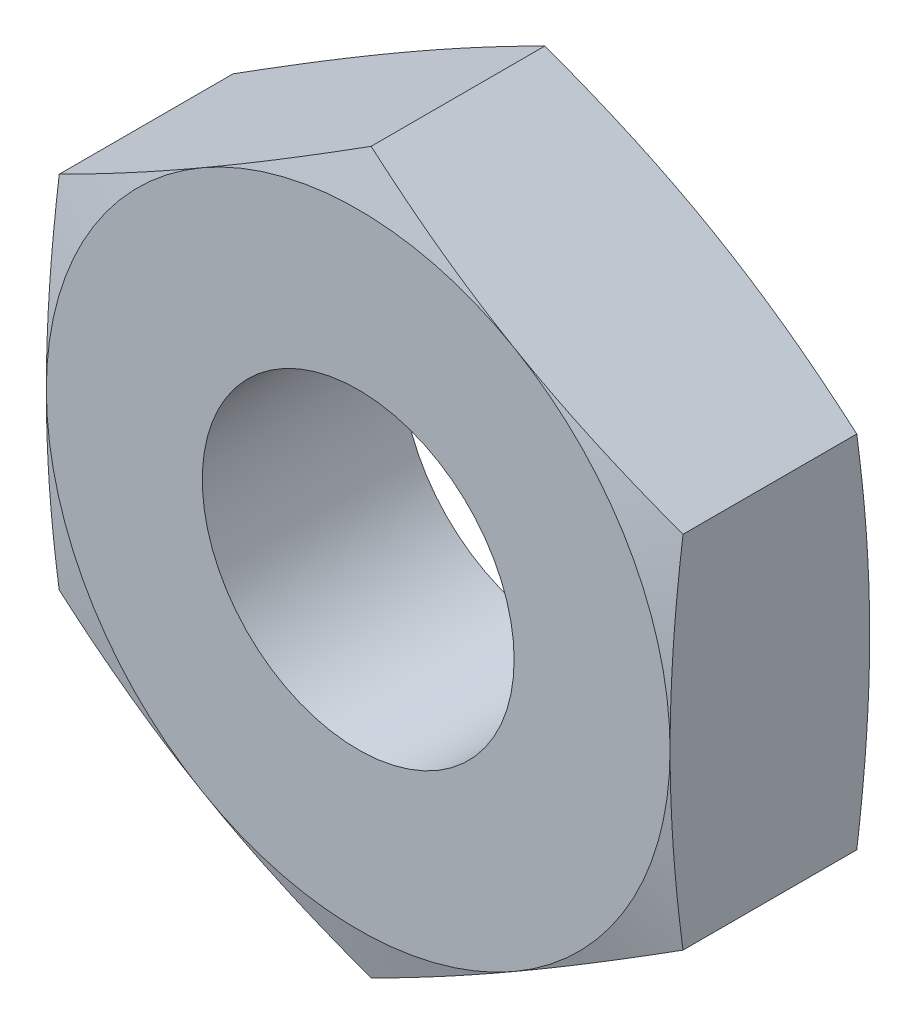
ISO-10303-21;
HEADER;
FILE_DESCRIPTION(('STEP AP214'),'2;1');
FILE_NAME('part.step','',(''),(''),'','','');
FILE_SCHEMA(('AUTOMOTIVE_DESIGN { 1 0 10303 214 1 1 1 1 }'));
ENDSEC;
DATA;
#1=APPLICATION_CONTEXT('core data for automotive mechanical design processes');
#2=APPLICATION_PROTOCOL_DEFINITION('international standard','automotive_design',2000,#1);
#3=PRODUCT_CONTEXT('',#1,'mechanical');
#4=PRODUCT('Part','Part','',(#3));
#5=PRODUCT_RELATED_PRODUCT_CATEGORY('part','',(#4));
#6=PRODUCT_DEFINITION_FORMATION('','',#4);
#7=PRODUCT_DEFINITION_CONTEXT('part definition',#1,'design');
#8=PRODUCT_DEFINITION('design','',#6,#7);
#9=PRODUCT_DEFINITION_SHAPE('','',#8);
#10=(LENGTH_UNIT() NAMED_UNIT(*) SI_UNIT(.MILLI.,.METRE.));
#11=(NAMED_UNIT(*) PLANE_ANGLE_UNIT() SI_UNIT($,.RADIAN.));
#12=(NAMED_UNIT(*) SI_UNIT($,.STERADIAN.) SOLID_ANGLE_UNIT());
#13=UNCERTAINTY_MEASURE_WITH_UNIT(LENGTH_MEASURE(1.E-05),#10,'distance_accuracy_value','');
#14=(GEOMETRIC_REPRESENTATION_CONTEXT(3) GLOBAL_UNCERTAINTY_ASSIGNED_CONTEXT((#13)) GLOBAL_UNIT_ASSIGNED_CONTEXT((#10,
#11,#12)) REPRESENTATION_CONTEXT('',''));
#15=CARTESIAN_POINT('',(0.,0.,0.));
#16=DIRECTION('',(0.,0.,1.));
#17=DIRECTION('',(1.,0.,0.));
#18=AXIS2_PLACEMENT_3D('',#15,#16,#17);
#19=CARTESIAN_POINT('',(0.,5.77350269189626,3.2));
#20=DIRECTION('',(0.5,-0.866025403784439,0.));
#21=DIRECTION('',(0.866025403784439,0.5,0.));
#22=AXIS2_PLACEMENT_3D('',#19,#20,#21);
#23=PLANE('',#22);
#24=CARTESIAN_POINT('',(-5.0002,2.88663587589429,0.20729036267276));
#25=CARTESIAN_POINT('',(-4.79254599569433,3.00652497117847,0.175152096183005));
#26=CARTESIAN_POINT('',(-4.58451548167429,3.1266314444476,0.145975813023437));
#27=CARTESIAN_POINT('',(-4.16771975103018,3.36726857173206,0.094715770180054));
#28=CARTESIAN_POINT('',(-3.95895427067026,3.48779937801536,0.0726348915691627));
#29=CARTESIAN_POINT('',(-3.54195440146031,3.72855436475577,0.0368547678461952));
#30=CARTESIAN_POINT('',(-3.33372283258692,3.8487769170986,0.0231128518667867));
#31=CARTESIAN_POINT('',(-2.91699413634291,4.08937534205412,0.00468634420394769));
#32=CARTESIAN_POINT('',(-2.70849706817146,4.20975118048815,0.));
#33=CARTESIAN_POINT('',(-2.29150293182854,4.45050285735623,0.));
#34=CARTESIAN_POINT('',(-2.08300586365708,4.57087869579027,0.00468634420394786));
#35=CARTESIAN_POINT('',(-1.66627716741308,4.81147712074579,0.0231128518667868));
#36=CARTESIAN_POINT('',(-1.45804559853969,4.93169967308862,0.0368547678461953));
#37=CARTESIAN_POINT('',(-1.04104572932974,5.17245465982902,0.0726348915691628));
#38=CARTESIAN_POINT('',(-0.832280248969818,5.29298546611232,0.0947157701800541));
#39=CARTESIAN_POINT('',(-0.415484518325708,5.53362259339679,0.145975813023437));
#40=CARTESIAN_POINT('',(-0.207454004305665,5.65372906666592,0.175152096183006));
#41=CARTESIAN_POINT('',(0.000200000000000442,5.7736181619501,0.20729036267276));
#42=B_SPLINE_CURVE_WITH_KNOTS('',3,(#24,#25,#26,#27,#28,#29,#30,#31,#32,#33,#34,#35,#36,#37,#38,
#39,#40,#41),.UNSPECIFIED.,.F.,.F.,(4,2,2,2,2,2,2,2,4),(0.,0.725805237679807,1.45190481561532,
2.17425686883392,2.89646911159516,3.6186813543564,4.34103340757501,5.06713298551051,
5.79293822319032),.UNSPECIFIED.);
#43=CARTESIAN_POINT('',(-5.,2.88675134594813,0.207259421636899));
#44=VERTEX_POINT('',#43);
#45=CARTESIAN_POINT('',(-2.5,4.33012701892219,0.));
#46=VERTEX_POINT('',#45);
#47=EDGE_CURVE('E52',#44,#46,#42,.T.);
#48=ORIENTED_EDGE('',*,*,#47,.F.);
#49=DIRECTION('',(0.,0.,-1.));
#50=VECTOR('',#49,1.);
#51=CARTESIAN_POINT('',(-5.,2.88675134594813,3.2));
#52=LINE('',#51,#50);
#53=CARTESIAN_POINT('',(-5.,2.88675134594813,2.9927405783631));
#54=VERTEX_POINT('',#53);
#55=EDGE_CURVE('E276',#54,#44,#52,.T.);
#56=ORIENTED_EDGE('',*,*,#55,.F.);
#57=CARTESIAN_POINT('',(0.000200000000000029,5.7736181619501,2.99270963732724));
#58=CARTESIAN_POINT('',(-0.207454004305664,5.65372906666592,3.02484790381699));
#59=CARTESIAN_POINT('',(-0.415484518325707,5.53362259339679,3.05402418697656));
#60=CARTESIAN_POINT('',(-0.832280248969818,5.29298546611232,3.10528422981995));
#61=CARTESIAN_POINT('',(-1.04104572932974,5.17245465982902,3.12736510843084));
#62=CARTESIAN_POINT('',(-1.45804559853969,4.93169967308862,3.16314523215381));
#63=CARTESIAN_POINT('',(-1.66627716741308,4.81147712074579,3.17688714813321));
#64=CARTESIAN_POINT('',(-2.08300586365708,4.57087869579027,3.19531365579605));
#65=CARTESIAN_POINT('',(-2.29150293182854,4.45050285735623,3.2));
#66=CARTESIAN_POINT('',(-2.70849706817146,4.20975118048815,3.2));
#67=CARTESIAN_POINT('',(-2.91699413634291,4.08937534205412,3.19531365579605));
#68=CARTESIAN_POINT('',(-3.33372283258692,3.8487769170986,3.17688714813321));
#69=CARTESIAN_POINT('',(-3.54195440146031,3.72855436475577,3.16314523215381));
#70=CARTESIAN_POINT('',(-3.95895427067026,3.48779937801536,3.12736510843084));
#71=CARTESIAN_POINT('',(-4.16771975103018,3.36726857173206,3.10528422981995));
#72=CARTESIAN_POINT('',(-4.58451548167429,3.1266314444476,3.05402418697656));
#73=CARTESIAN_POINT('',(-4.79254599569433,3.00652497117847,3.02484790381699));
#74=CARTESIAN_POINT('',(-5.0002,2.88663587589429,2.99270963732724));
#75=B_SPLINE_CURVE_WITH_KNOTS('',3,(#57,#58,#59,#60,#61,#62,#63,#64,#65,#66,#67,#68,#69,#70,#71,
#72,#73,#74),.UNSPECIFIED.,.F.,.F.,(4,2,2,2,2,2,2,2,4),(0.,0.725805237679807,1.45190481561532,
2.17425686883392,2.89646911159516,3.6186813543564,4.34103340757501,5.06713298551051,
5.79293822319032),.UNSPECIFIED.);
#76=CARTESIAN_POINT('',(-2.5,4.33012701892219,3.2));
#77=VERTEX_POINT('',#76);
#78=EDGE_CURVE('E217',#77,#54,#75,.T.);
#79=ORIENTED_EDGE('',*,*,#78,.F.);
#80=CARTESIAN_POINT('',(0.,5.77350269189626,2.9927405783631));
#81=VERTEX_POINT('',#80);
#82=EDGE_CURVE('E297',#81,#77,#75,.T.);
#83=ORIENTED_EDGE('',*,*,#82,.F.);
#84=DIRECTION('',(0.,0.,-1.));
#85=VECTOR('',#84,1.);
#86=CARTESIAN_POINT('',(0.,5.77350269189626,3.2));
#87=LINE('',#86,#85);
#88=CARTESIAN_POINT('',(0.,5.77350269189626,0.2072594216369));
#89=VERTEX_POINT('',#88);
#90=EDGE_CURVE('E305',#81,#89,#87,.T.);
#91=ORIENTED_EDGE('',*,*,#90,.T.);
#92=EDGE_CURVE('E137',#46,#89,#42,.T.);
#93=ORIENTED_EDGE('',*,*,#92,.F.);
#94=EDGE_LOOP('',(#48,#56,#79,#83,#91,#93));
#95=FACE_BOUND('',#94,.T.);
#96=ADVANCED_FACE('F36',(#95),#23,.F.);
#97=CARTESIAN_POINT('',(-5.,2.88675134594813,3.2));
#98=DIRECTION('',(1.,0.,0.));
#99=DIRECTION('',(0.,1.,0.));
#100=AXIS2_PLACEMENT_3D('',#97,#98,#99);
#101=PLANE('',#100);
#102=CARTESIAN_POINT('',(-5.,-7.73288069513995,1.12767831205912));
#103=CARTESIAN_POINT('',(-5.,-7.50482920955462,1.07637789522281));
#104=CARTESIAN_POINT('',(-5.,-7.27663767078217,1.02568918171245));
#105=CARTESIAN_POINT('',(-5.,-6.81990544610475,0.925865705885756));
#106=CARTESIAN_POINT('',(-5.,-6.59136474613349,0.876731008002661));
#107=CARTESIAN_POINT('',(-5.,-6.13367883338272,0.780307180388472));
#108=CARTESIAN_POINT('',(-5.,-5.90453326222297,0.73301974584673));
#109=CARTESIAN_POINT('',(-5.,-5.44577187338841,0.640784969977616));
#110=CARTESIAN_POINT('',(-5.,-5.21615605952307,0.595837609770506));
#111=CARTESIAN_POINT('',(-5.,-4.75838964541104,0.509224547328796));
#112=CARTESIAN_POINT('',(-5.,-4.53024386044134,0.467533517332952));
#113=CARTESIAN_POINT('',(-5.,-4.07333559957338,0.387686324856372));
#114=CARTESIAN_POINT('',(-5.,-3.84457313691,0.349530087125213));
#115=CARTESIAN_POINT('',(-5.,-3.38637160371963,0.277590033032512));
#116=CARTESIAN_POINT('',(-5.,-3.15693257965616,0.243805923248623));
#117=CARTESIAN_POINT('',(-5.,-2.69732184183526,0.181588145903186));
#118=CARTESIAN_POINT('',(-5.,-2.46715012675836,0.153154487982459));
#119=CARTESIAN_POINT('',(-5.,-2.00341695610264,0.102418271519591));
#120=CARTESIAN_POINT('',(-5.,-1.76984717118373,0.0801907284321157));
#121=CARTESIAN_POINT('',(-5.,-1.30210014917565,0.0433894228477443));
#122=CARTESIAN_POINT('',(-5.,-1.06792292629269,0.0288154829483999));
#123=CARTESIAN_POINT('',(-5.,-0.599311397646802,0.00816978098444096));
#124=CARTESIAN_POINT('',(-5.,-0.364877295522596,0.00209348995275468));
#125=CARTESIAN_POINT('',(-5.,0.104053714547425,-0.00118222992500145));
#126=CARTESIAN_POINT('',(-5.,0.338550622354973,0.00161832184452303));
#127=CARTESIAN_POINT('',(-5.,0.808306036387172,0.0159455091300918));
#128=CARTESIAN_POINT('',(-5.,1.04356334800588,0.0275105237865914));
#129=CARTESIAN_POINT('',(-5.,1.51354514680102,0.0587057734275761));
#130=CARTESIAN_POINT('',(-5.,1.74826960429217,0.0783364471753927));
#131=CARTESIAN_POINT('',(-5.,2.21718037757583,0.12464735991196));
#132=CARTESIAN_POINT('',(-5.,2.4513661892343,0.151332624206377));
#133=CARTESIAN_POINT('',(-5.,2.91897825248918,0.210612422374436));
#134=CARTESIAN_POINT('',(-5.,3.15240450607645,0.243206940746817));
#135=CARTESIAN_POINT('',(-5.,3.65615024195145,0.318882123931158));
#136=CARTESIAN_POINT('',(-5.,3.92634202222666,0.362806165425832));
#137=CARTESIAN_POINT('',(-5.,4.46585389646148,0.45573682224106));
#138=CARTESIAN_POINT('',(-5.,4.73517394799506,0.504743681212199));
#139=CARTESIAN_POINT('',(-5.,5.2731098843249,0.606708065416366));
#140=CARTESIAN_POINT('',(-5.,5.54172563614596,0.659666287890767));
#141=CARTESIAN_POINT('',(-5.,6.07833604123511,0.768650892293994));
#142=CARTESIAN_POINT('',(-5.,6.3463306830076,0.824677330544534));
#143=CARTESIAN_POINT('',(-5.,6.88192475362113,0.939158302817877));
#144=CARTESIAN_POINT('',(-5.,7.14952395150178,0.997613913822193));
#145=CARTESIAN_POINT('',(-5.,7.68429934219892,1.116431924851));
#146=CARTESIAN_POINT('',(-5.,7.95147553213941,1.17679433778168));
#147=CARTESIAN_POINT('',(-5.,8.75249547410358,1.36014741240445));
#148=CARTESIAN_POINT('',(-5.,9.28582090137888,1.48540180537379));
#149=CARTESIAN_POINT('',(-5.,10.0812932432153,1.67535035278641));
#150=CARTESIAN_POINT('',(-5.,10.3438020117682,1.73854343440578));
#151=CARTESIAN_POINT('',(-5.,10.868619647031,1.86574073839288));
#152=CARTESIAN_POINT('',(-5.,11.1309285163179,1.92974495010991));
#153=CARTESIAN_POINT('',(-5.,11.9176287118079,2.12276878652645));
#154=CARTESIAN_POINT('',(-5.,12.4417729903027,2.25279466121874));
#155=CARTESIAN_POINT('',(-5.,13.488641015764,2.51451449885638));
#156=CARTESIAN_POINT('',(-5.,14.0113656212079,2.64620503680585));
#157=CARTESIAN_POINT('',(-5.,15.0564278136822,2.91101333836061));
#158=CARTESIAN_POINT('',(-5.,15.5787654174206,3.04413103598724));
#159=CARTESIAN_POINT('',(-5.,16.1009778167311,3.17773348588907));
#160=B_SPLINE_CURVE_WITH_KNOTS('',3,(#102,#103,#104,#105,#106,#107,#108,#109,#110,#111,#112,
#113,#114,#115,#116,#117,#118,#119,#120,#121,#122,#123,#124,#125,#126,#127,#128,#129,#130,#131,
#132,#133,#134,#135,#136,#137,#138,#139,#140,#141,#142,#143,#144,#145,#146,#147,#148,#149,#150,
#151,#152,#153,#154,#155,#156,#157,#158,#159),.UNSPECIFIED.,.F.,.F.,(4,2,2,2,2,2,2,2,2,2,2,2,2,
2,2,2,2,2,2,2,2,2,2,2,2,2,2,2,4),(0.,0.701253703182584,1.40253644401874,2.10444830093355,
2.80635449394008,3.50210365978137,4.1978380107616,4.89352564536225,5.58921453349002,
6.29298044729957,6.99673004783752,7.70010442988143,8.40347727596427,9.10994808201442,
9.81645732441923,10.5234712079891,11.2304832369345,12.0516350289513,12.8728262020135,
13.6941626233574,14.5155141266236,15.3372337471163,16.1589589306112,17.8024390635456,
18.6124621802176,19.4224746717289,21.042563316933,22.6597349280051,24.2768320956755),.UNSPECIFIED.);
#161=CARTESIAN_POINT('',(-5.,-2.88675134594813,0.207259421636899));
#162=VERTEX_POINT('',#161);
#163=CARTESIAN_POINT('',(-5.,0.,0.));
#164=VERTEX_POINT('',#163);
#165=EDGE_CURVE('E60',#162,#164,#160,.T.);
#166=ORIENTED_EDGE('',*,*,#165,.F.);
#167=DIRECTION('',(0.,0.,-1.));
#168=VECTOR('',#167,1.);
#169=CARTESIAN_POINT('',(-5.,-2.88675134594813,3.2));
#170=LINE('',#169,#168);
#171=CARTESIAN_POINT('',(-5.,-2.88675134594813,2.9927405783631));
#172=VERTEX_POINT('',#171);
#173=EDGE_CURVE('E274',#172,#162,#170,.T.);
#174=ORIENTED_EDGE('',*,*,#173,.F.);
#175=CARTESIAN_POINT('',(-5.,-7.73288069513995,2.07232168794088));
#176=CARTESIAN_POINT('',(-5.,-7.50482920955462,2.12362210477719));
#177=CARTESIAN_POINT('',(-5.,-7.27663767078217,2.17431081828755));
#178=CARTESIAN_POINT('',(-5.,-6.81990544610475,2.27413429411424));
#179=CARTESIAN_POINT('',(-5.,-6.5913647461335,2.32326899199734));
#180=CARTESIAN_POINT('',(-5.,-6.13367883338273,2.41969281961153));
#181=CARTESIAN_POINT('',(-5.,-5.90453326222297,2.46698025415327));
#182=CARTESIAN_POINT('',(-5.,-5.44577187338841,2.55921503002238));
#183=CARTESIAN_POINT('',(-5.,-5.21615605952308,2.60416239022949));
#184=CARTESIAN_POINT('',(-5.,-4.75838964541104,2.6907754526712));
#185=CARTESIAN_POINT('',(-5.,-4.53024386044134,2.73246648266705));
#186=CARTESIAN_POINT('',(-5.,-4.07333559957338,2.81231367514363));
#187=CARTESIAN_POINT('',(-5.,-3.84457313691,2.85046991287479));
#188=CARTESIAN_POINT('',(-5.,-3.38637160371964,2.92240996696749));
#189=CARTESIAN_POINT('',(-5.,-3.15693257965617,2.95619407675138));
#190=CARTESIAN_POINT('',(-5.,-2.69732184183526,3.01841185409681));
#191=CARTESIAN_POINT('',(-5.,-2.46715012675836,3.04684551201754));
#192=CARTESIAN_POINT('',(-5.,-2.00341695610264,3.09758172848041));
#193=CARTESIAN_POINT('',(-5.,-1.76984717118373,3.11980927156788));
#194=CARTESIAN_POINT('',(-5.,-1.30210014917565,3.15661057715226));
#195=CARTESIAN_POINT('',(-5.,-1.06792292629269,3.1711845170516));
#196=CARTESIAN_POINT('',(-5.,-0.599311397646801,3.19183021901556));
#197=CARTESIAN_POINT('',(-5.,-0.364877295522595,3.19790651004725));
#198=CARTESIAN_POINT('',(-5.,0.104053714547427,3.201182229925));
#199=CARTESIAN_POINT('',(-5.,0.338550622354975,3.19838167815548));
#200=CARTESIAN_POINT('',(-5.,0.808306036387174,3.18405449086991));
#201=CARTESIAN_POINT('',(-5.,1.04356334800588,3.17248947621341));
#202=CARTESIAN_POINT('',(-5.,1.51354514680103,3.14129422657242));
#203=CARTESIAN_POINT('',(-5.,1.74826960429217,3.12166355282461));
#204=CARTESIAN_POINT('',(-5.,2.21718037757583,3.07535264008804));
#205=CARTESIAN_POINT('',(-5.,2.4513661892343,3.04866737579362));
#206=CARTESIAN_POINT('',(-5.,2.91897825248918,2.98938757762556));
#207=CARTESIAN_POINT('',(-5.,3.15240450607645,2.95679305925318));
#208=CARTESIAN_POINT('',(-5.,3.65615024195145,2.88111787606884));
#209=CARTESIAN_POINT('',(-5.,3.92634202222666,2.83719383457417));
#210=CARTESIAN_POINT('',(-5.,4.46585389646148,2.74426317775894));
#211=CARTESIAN_POINT('',(-5.,4.73517394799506,2.6952563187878));
#212=CARTESIAN_POINT('',(-5.,5.2731098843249,2.59329193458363));
#213=CARTESIAN_POINT('',(-5.,5.54172563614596,2.54033371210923));
#214=CARTESIAN_POINT('',(-5.,6.0783360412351,2.43134910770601));
#215=CARTESIAN_POINT('',(-5.,6.34633068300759,2.37532266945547));
#216=CARTESIAN_POINT('',(-5.,6.88192475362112,2.26084169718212));
#217=CARTESIAN_POINT('',(-5.,7.14952395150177,2.20238608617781));
#218=CARTESIAN_POINT('',(-5.,7.68429934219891,2.083568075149));
#219=CARTESIAN_POINT('',(-5.,7.95147553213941,2.02320566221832));
#220=CARTESIAN_POINT('',(-5.,8.75249547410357,1.83985258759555));
#221=CARTESIAN_POINT('',(-5.,9.28582090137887,1.71459819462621));
#222=CARTESIAN_POINT('',(-5.,10.0812932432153,1.52464964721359));
#223=CARTESIAN_POINT('',(-5.,10.3438020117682,1.46145656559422));
#224=CARTESIAN_POINT('',(-5.,10.8686196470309,1.33425926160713));
#225=CARTESIAN_POINT('',(-5.,11.1309285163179,1.27025504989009));
#226=CARTESIAN_POINT('',(-5.,11.9176287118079,1.07723121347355));
#227=CARTESIAN_POINT('',(-5.,12.4417729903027,0.947205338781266));
#228=CARTESIAN_POINT('',(-5.,13.488641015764,0.685485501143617));
#229=CARTESIAN_POINT('',(-5.,14.0113656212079,0.553794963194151));
#230=CARTESIAN_POINT('',(-5.,15.0564278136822,0.28898666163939));
#231=CARTESIAN_POINT('',(-5.,15.5787654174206,0.155868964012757));
#232=CARTESIAN_POINT('',(-5.,16.1009778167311,0.0222665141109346));
#233=B_SPLINE_CURVE_WITH_KNOTS('',3,(#175,#176,#177,#178,#179,#180,#181,#182,#183,#184,#185,
#186,#187,#188,#189,#190,#191,#192,#193,#194,#195,#196,#197,#198,#199,#200,#201,#202,#203,#204,
#205,#206,#207,#208,#209,#210,#211,#212,#213,#214,#215,#216,#217,#218,#219,#220,#221,#222,#223,
#224,#225,#226,#227,#228,#229,#230,#231,#232),.UNSPECIFIED.,.F.,.F.,(4,2,2,2,2,2,2,2,2,2,2,2,2,
2,2,2,2,2,2,2,2,2,2,2,2,2,2,2,4),(0.,0.701253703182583,1.40253644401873,2.10444830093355,
2.80635449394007,3.50210365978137,4.1978380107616,4.89352564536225,5.58921453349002,
6.29298044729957,6.99673004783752,7.70010442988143,8.40347727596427,9.10994808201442,
9.81645732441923,10.5234712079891,11.2304832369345,12.0516350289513,12.8728262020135,
13.6941626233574,14.5155141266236,15.3372337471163,16.1589589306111,17.8024390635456,
18.6124621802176,19.4224746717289,21.042563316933,22.6597349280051,24.2768320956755),.UNSPECIFIED.);
#234=CARTESIAN_POINT('',(-5.,0.,3.2));
#235=VERTEX_POINT('',#234);
#236=EDGE_CURVE('E237',#235,#172,#233,.F.);
#237=ORIENTED_EDGE('',*,*,#236,.F.);
#238=EDGE_CURVE('E313',#54,#235,#233,.F.);
#239=ORIENTED_EDGE('',*,*,#238,.F.);
#240=ORIENTED_EDGE('',*,*,#55,.T.);
#241=EDGE_CURVE('E159',#164,#44,#160,.T.);
#242=ORIENTED_EDGE('',*,*,#241,.F.);
#243=EDGE_LOOP('',(#166,#174,#237,#239,#240,#242));
#244=FACE_BOUND('',#243,.T.);
#245=ADVANCED_FACE('F244',(#244),#101,.F.);
#246=CARTESIAN_POINT('',(0.,-5.77350269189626,3.2));
#247=DIRECTION('',(0.5,0.866025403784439,0.));
#248=DIRECTION('',(-0.866025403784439,0.5,0.));
#249=AXIS2_PLACEMENT_3D('',#246,#247,#248);
#250=PLANE('',#249);
#251=CARTESIAN_POINT('',(0.000200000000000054,-5.7736181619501,0.20729036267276));
#252=CARTESIAN_POINT('',(-0.207454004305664,-5.65372906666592,0.175152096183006));
#253=CARTESIAN_POINT('',(-0.415484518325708,-5.53362259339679,0.145975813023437));
#254=CARTESIAN_POINT('',(-0.832280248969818,-5.29298546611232,0.0947157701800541));
#255=CARTESIAN_POINT('',(-1.04104572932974,-5.17245465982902,0.0726348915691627));
#256=CARTESIAN_POINT('',(-1.45804559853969,-4.93169967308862,0.0368547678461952));
#257=CARTESIAN_POINT('',(-1.66627716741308,-4.81147712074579,0.0231128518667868));
#258=CARTESIAN_POINT('',(-2.08300586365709,-4.57087869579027,0.00468634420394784));
#259=CARTESIAN_POINT('',(-2.29150293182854,-4.45050285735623,0.));
#260=CARTESIAN_POINT('',(-2.70849706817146,-4.20975118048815,0.));
#261=CARTESIAN_POINT('',(-2.91699413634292,-4.08937534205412,0.00468634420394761));
#262=CARTESIAN_POINT('',(-3.33372283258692,-3.8487769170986,0.0231128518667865));
#263=CARTESIAN_POINT('',(-3.54195440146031,-3.72855436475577,0.0368547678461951));
#264=CARTESIAN_POINT('',(-3.95895427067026,-3.48779937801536,0.0726348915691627));
#265=CARTESIAN_POINT('',(-4.16771975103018,-3.36726857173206,0.0947157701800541));
#266=CARTESIAN_POINT('',(-4.58451548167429,-3.1266314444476,0.145975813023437));
#267=CARTESIAN_POINT('',(-4.79254599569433,-3.00652497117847,0.175152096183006));
#268=CARTESIAN_POINT('',(-5.0002,-2.88663587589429,0.20729036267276));
#269=B_SPLINE_CURVE_WITH_KNOTS('',3,(#251,#252,#253,#254,#255,#256,#257,#258,#259,#260,#261,
#262,#263,#264,#265,#266,#267,#268),.UNSPECIFIED.,.F.,.F.,(4,2,2,2,2,2,2,2,4),(0.,
0.725805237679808,1.45190481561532,2.17425686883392,2.89646911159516,3.6186813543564,
4.34103340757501,5.06713298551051,5.79293822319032),.UNSPECIFIED.);
#270=CARTESIAN_POINT('',(0.,-5.77350269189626,0.2072594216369));
#271=VERTEX_POINT('',#270);
#272=CARTESIAN_POINT('',(-2.5,-4.33012701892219,0.));
#273=VERTEX_POINT('',#272);
#274=EDGE_CURVE('E253',#271,#273,#269,.T.);
#275=ORIENTED_EDGE('',*,*,#274,.F.);
#276=DIRECTION('',(0.,0.,-1.));
#277=VECTOR('',#276,1.);
#278=CARTESIAN_POINT('',(0.,-5.77350269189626,3.2));
#279=LINE('',#278,#277);
#280=CARTESIAN_POINT('',(0.,-5.77350269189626,2.9927405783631));
#281=VERTEX_POINT('',#280);
#282=EDGE_CURVE('E268',#281,#271,#279,.T.);
#283=ORIENTED_EDGE('',*,*,#282,.F.);
#284=CARTESIAN_POINT('',(-5.0002,-2.88663587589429,2.99270963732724));
#285=CARTESIAN_POINT('',(-4.79254599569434,-3.00652497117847,3.02484790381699));
#286=CARTESIAN_POINT('',(-4.58451548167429,-3.1266314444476,3.05402418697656));
#287=CARTESIAN_POINT('',(-4.16771975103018,-3.36726857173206,3.10528422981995));
#288=CARTESIAN_POINT('',(-3.95895427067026,-3.48779937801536,3.12736510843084));
#289=CARTESIAN_POINT('',(-3.54195440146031,-3.72855436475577,3.16314523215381));
#290=CARTESIAN_POINT('',(-3.33372283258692,-3.8487769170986,3.17688714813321));
#291=CARTESIAN_POINT('',(-2.91699413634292,-4.08937534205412,3.19531365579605));
#292=CARTESIAN_POINT('',(-2.70849706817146,-4.20975118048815,3.2));
#293=CARTESIAN_POINT('',(-2.29150293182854,-4.45050285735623,3.2));
#294=CARTESIAN_POINT('',(-2.08300586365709,-4.57087869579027,3.19531365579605));
#295=CARTESIAN_POINT('',(-1.66627716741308,-4.81147712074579,3.17688714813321));
#296=CARTESIAN_POINT('',(-1.45804559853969,-4.93169967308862,3.1631452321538));
#297=CARTESIAN_POINT('',(-1.04104572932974,-5.17245465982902,3.12736510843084));
#298=CARTESIAN_POINT('',(-0.832280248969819,-5.29298546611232,3.10528422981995));
#299=CARTESIAN_POINT('',(-0.415484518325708,-5.53362259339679,3.05402418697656));
#300=CARTESIAN_POINT('',(-0.207454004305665,-5.65372906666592,3.02484790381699));
#301=CARTESIAN_POINT('',(0.000200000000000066,-5.7736181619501,2.99270963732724));
#302=B_SPLINE_CURVE_WITH_KNOTS('',3,(#284,#285,#286,#287,#288,#289,#290,#291,#292,#293,#294,
#295,#296,#297,#298,#299,#300,#301),.UNSPECIFIED.,.F.,.F.,(4,2,2,2,2,2,2,2,4),(0.,
0.725805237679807,1.45190481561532,2.17425686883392,2.89646911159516,3.6186813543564,
4.34103340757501,5.06713298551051,5.79293822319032),.UNSPECIFIED.);
#303=CARTESIAN_POINT('',(-2.5,-4.33012701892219,3.2));
#304=VERTEX_POINT('',#303);
#305=EDGE_CURVE('E231',#304,#281,#302,.T.);
#306=ORIENTED_EDGE('',*,*,#305,.F.);
#307=EDGE_CURVE('E235',#172,#304,#302,.T.);
#308=ORIENTED_EDGE('',*,*,#307,.F.);
#309=ORIENTED_EDGE('',*,*,#173,.T.);
#310=EDGE_CURVE('E248',#273,#162,#269,.T.);
#311=ORIENTED_EDGE('',*,*,#310,.F.);
#312=EDGE_LOOP('',(#275,#283,#306,#308,#309,#311));
#313=FACE_BOUND('',#312,.T.);
#314=ADVANCED_FACE('F241',(#313),#250,.F.);
#315=CARTESIAN_POINT('',(0.,-5.77350269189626,3.2));
#316=DIRECTION('',(-0.5,0.866025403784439,0.));
#317=DIRECTION('',(-0.866025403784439,-0.5,0.));
#318=AXIS2_PLACEMENT_3D('',#315,#316,#317);
#319=PLANE('',#318);
#320=CARTESIAN_POINT('',(5.0002,-2.88663587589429,0.20729036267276));
#321=CARTESIAN_POINT('',(4.79254599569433,-3.00652497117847,0.175152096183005));
#322=CARTESIAN_POINT('',(4.58451548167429,-3.1266314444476,0.145975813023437));
#323=CARTESIAN_POINT('',(4.16771975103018,-3.36726857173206,0.0947157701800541));
#324=CARTESIAN_POINT('',(3.95895427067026,-3.48779937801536,0.0726348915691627));
#325=CARTESIAN_POINT('',(3.54195440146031,-3.72855436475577,0.0368547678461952));
#326=CARTESIAN_POINT('',(3.33372283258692,-3.8487769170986,0.0231128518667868));
#327=CARTESIAN_POINT('',(2.91699413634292,-4.08937534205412,0.00468634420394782));
#328=CARTESIAN_POINT('',(2.70849706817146,-4.20975118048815,0.));
#329=CARTESIAN_POINT('',(2.29150293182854,-4.45050285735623,0.));
#330=CARTESIAN_POINT('',(2.08300586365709,-4.57087869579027,0.00468634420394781));
#331=CARTESIAN_POINT('',(1.66627716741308,-4.81147712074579,0.0231128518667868));
#332=CARTESIAN_POINT('',(1.45804559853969,-4.93169967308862,0.0368547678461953));
#333=CARTESIAN_POINT('',(1.04104572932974,-5.17245465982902,0.0726348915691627));
#334=CARTESIAN_POINT('',(0.832280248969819,-5.29298546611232,0.0947157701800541));
#335=CARTESIAN_POINT('',(0.415484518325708,-5.53362259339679,0.145975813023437));
#336=CARTESIAN_POINT('',(0.207454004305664,-5.65372906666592,0.175152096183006));
#337=CARTESIAN_POINT('',(-0.000200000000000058,-5.7736181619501,0.20729036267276));
#338=B_SPLINE_CURVE_WITH_KNOTS('',3,(#320,#321,#322,#323,#324,#325,#326,#327,#328,#329,#330,
#331,#332,#333,#334,#335,#336,#337),.UNSPECIFIED.,.F.,.F.,(4,2,2,2,2,2,2,2,4),(0.,
0.725805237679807,1.45190481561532,2.17425686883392,2.89646911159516,3.6186813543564,
4.34103340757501,5.06713298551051,5.79293822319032),.UNSPECIFIED.);
#339=CARTESIAN_POINT('',(5.,-2.88675134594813,0.207259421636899));
#340=VERTEX_POINT('',#339);
#341=CARTESIAN_POINT('',(2.5,-4.33012701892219,0.));
#342=VERTEX_POINT('',#341);
#343=EDGE_CURVE('E146',#340,#342,#338,.T.);
#344=ORIENTED_EDGE('',*,*,#343,.F.);
#345=DIRECTION('',(0.,0.,-1.));
#346=VECTOR('',#345,1.);
#347=CARTESIAN_POINT('',(5.,-2.88675134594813,3.2));
#348=LINE('',#347,#346);
#349=CARTESIAN_POINT('',(5.,-2.88675134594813,2.9927405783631));
#350=VERTEX_POINT('',#349);
#351=EDGE_CURVE('E158',#350,#340,#348,.T.);
#352=ORIENTED_EDGE('',*,*,#351,.F.);
#353=CARTESIAN_POINT('',(-0.000200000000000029,-5.7736181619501,2.99270963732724));
#354=CARTESIAN_POINT('',(0.207454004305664,-5.65372906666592,3.02484790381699));
#355=CARTESIAN_POINT('',(0.415484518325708,-5.53362259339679,3.05402418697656));
#356=CARTESIAN_POINT('',(0.832280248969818,-5.29298546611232,3.10528422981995));
#357=CARTESIAN_POINT('',(1.04104572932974,-5.17245465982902,3.12736510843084));
#358=CARTESIAN_POINT('',(1.45804559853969,-4.93169967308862,3.1631452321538));
#359=CARTESIAN_POINT('',(1.66627716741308,-4.81147712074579,3.17688714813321));
#360=CARTESIAN_POINT('',(2.08300586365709,-4.57087869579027,3.19531365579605));
#361=CARTESIAN_POINT('',(2.29150293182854,-4.45050285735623,3.2));
#362=CARTESIAN_POINT('',(2.70849706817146,-4.20975118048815,3.2));
#363=CARTESIAN_POINT('',(2.91699413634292,-4.08937534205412,3.19531365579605));
#364=CARTESIAN_POINT('',(3.33372283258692,-3.8487769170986,3.17688714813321));
#365=CARTESIAN_POINT('',(3.54195440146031,-3.72855436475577,3.16314523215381));
#366=CARTESIAN_POINT('',(3.95895427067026,-3.48779937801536,3.12736510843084));
#367=CARTESIAN_POINT('',(4.16771975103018,-3.36726857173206,3.10528422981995));
#368=CARTESIAN_POINT('',(4.58451548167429,-3.1266314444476,3.05402418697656));
#369=CARTESIAN_POINT('',(4.79254599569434,-3.00652497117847,3.02484790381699));
#370=CARTESIAN_POINT('',(5.0002,-2.88663587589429,2.99270963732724));
#371=B_SPLINE_CURVE_WITH_KNOTS('',3,(#353,#354,#355,#356,#357,#358,#359,#360,#361,#362,#363,
#364,#365,#366,#367,#368,#369,#370),.UNSPECIFIED.,.F.,.F.,(4,2,2,2,2,2,2,2,4),(0.,
0.725805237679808,1.45190481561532,2.17425686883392,2.89646911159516,3.6186813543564,
4.34103340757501,5.06713298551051,5.79293822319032),.UNSPECIFIED.);
#372=CARTESIAN_POINT('',(2.5,-4.33012701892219,3.2));
#373=VERTEX_POINT('',#372);
#374=EDGE_CURVE('E200',#373,#350,#371,.T.);
#375=ORIENTED_EDGE('',*,*,#374,.F.);
#376=EDGE_CURVE('E236',#281,#373,#371,.T.);
#377=ORIENTED_EDGE('',*,*,#376,.F.);
#378=ORIENTED_EDGE('',*,*,#282,.T.);
#379=EDGE_CURVE('E161',#342,#271,#338,.T.);
#380=ORIENTED_EDGE('',*,*,#379,.F.);
#381=EDGE_LOOP('',(#344,#352,#375,#377,#378,#380));
#382=FACE_BOUND('',#381,.T.);
#383=ADVANCED_FACE('F184',(#382),#319,.F.);
#384=CARTESIAN_POINT('',(5.,2.88675134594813,3.2));
#385=DIRECTION('',(-1.,0.,0.));
#386=DIRECTION('',(0.,-1.,0.));
#387=AXIS2_PLACEMENT_3D('',#384,#385,#386);
#388=PLANE('',#387);
#389=CARTESIAN_POINT('',(5.,-7.73288069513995,1.12767831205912));
#390=CARTESIAN_POINT('',(5.,-7.50482920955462,1.07637789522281));
#391=CARTESIAN_POINT('',(5.,-7.27663767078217,1.02568918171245));
#392=CARTESIAN_POINT('',(5.,-6.81990544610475,0.925865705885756));
#393=CARTESIAN_POINT('',(5.,-6.59136474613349,0.876731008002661));
#394=CARTESIAN_POINT('',(5.,-6.13367883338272,0.780307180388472));
#395=CARTESIAN_POINT('',(5.,-5.90453326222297,0.73301974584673));
#396=CARTESIAN_POINT('',(5.,-5.44577187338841,0.640784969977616));
#397=CARTESIAN_POINT('',(5.,-5.21615605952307,0.595837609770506));
#398=CARTESIAN_POINT('',(5.,-4.75838964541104,0.509224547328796));
#399=CARTESIAN_POINT('',(5.,-4.53024386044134,0.467533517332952));
#400=CARTESIAN_POINT('',(5.,-4.07333559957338,0.387686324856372));
#401=CARTESIAN_POINT('',(5.,-3.84457313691,0.349530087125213));
#402=CARTESIAN_POINT('',(5.,-3.38637160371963,0.277590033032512));
#403=CARTESIAN_POINT('',(5.,-3.15693257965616,0.243805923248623));
#404=CARTESIAN_POINT('',(5.,-2.69732184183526,0.181588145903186));
#405=CARTESIAN_POINT('',(5.,-2.46715012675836,0.153154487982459));
#406=CARTESIAN_POINT('',(5.,-2.00341695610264,0.102418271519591));
#407=CARTESIAN_POINT('',(5.,-1.76984717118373,0.0801907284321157));
#408=CARTESIAN_POINT('',(5.,-1.30210014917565,0.0433894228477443));
#409=CARTESIAN_POINT('',(5.,-1.06792292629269,0.0288154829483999));
#410=CARTESIAN_POINT('',(5.,-0.599311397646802,0.00816978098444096));
#411=CARTESIAN_POINT('',(5.,-0.364877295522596,0.00209348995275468));
#412=CARTESIAN_POINT('',(5.,0.104053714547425,-0.00118222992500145));
#413=CARTESIAN_POINT('',(5.,0.338550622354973,0.00161832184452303));
#414=CARTESIAN_POINT('',(5.,0.808306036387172,0.0159455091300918));
#415=CARTESIAN_POINT('',(5.,1.04356334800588,0.0275105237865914));
#416=CARTESIAN_POINT('',(5.,1.51354514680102,0.0587057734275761));
#417=CARTESIAN_POINT('',(5.,1.74826960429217,0.0783364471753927));
#418=CARTESIAN_POINT('',(5.,2.21718037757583,0.12464735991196));
#419=CARTESIAN_POINT('',(5.,2.4513661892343,0.151332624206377));
#420=CARTESIAN_POINT('',(5.,2.91897825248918,0.210612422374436));
#421=CARTESIAN_POINT('',(5.,3.15240450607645,0.243206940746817));
#422=CARTESIAN_POINT('',(5.,3.65615024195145,0.318882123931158));
#423=CARTESIAN_POINT('',(5.,3.92634202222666,0.362806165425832));
#424=CARTESIAN_POINT('',(5.,4.46585389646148,0.45573682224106));
#425=CARTESIAN_POINT('',(5.,4.73517394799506,0.504743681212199));
#426=CARTESIAN_POINT('',(5.,5.2731098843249,0.606708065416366));
#427=CARTESIAN_POINT('',(5.,5.54172563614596,0.659666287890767));
#428=CARTESIAN_POINT('',(5.,6.07833604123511,0.768650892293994));
#429=CARTESIAN_POINT('',(5.,6.3463306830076,0.824677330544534));
#430=CARTESIAN_POINT('',(5.,6.88192475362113,0.939158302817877));
#431=CARTESIAN_POINT('',(5.,7.14952395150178,0.997613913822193));
#432=CARTESIAN_POINT('',(5.,7.68429934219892,1.116431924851));
#433=CARTESIAN_POINT('',(5.,7.95147553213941,1.17679433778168));
#434=CARTESIAN_POINT('',(5.,8.75249547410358,1.36014741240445));
#435=CARTESIAN_POINT('',(5.,9.28582090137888,1.48540180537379));
#436=CARTESIAN_POINT('',(5.,10.0812932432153,1.67535035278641));
#437=CARTESIAN_POINT('',(5.,10.3438020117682,1.73854343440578));
#438=CARTESIAN_POINT('',(5.,10.868619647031,1.86574073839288));
#439=CARTESIAN_POINT('',(5.,11.1309285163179,1.92974495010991));
#440=CARTESIAN_POINT('',(5.,11.9176287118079,2.12276878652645));
#441=CARTESIAN_POINT('',(5.,12.4417729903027,2.25279466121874));
#442=CARTESIAN_POINT('',(5.,13.488641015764,2.51451449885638));
#443=CARTESIAN_POINT('',(5.,14.0113656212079,2.64620503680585));
#444=CARTESIAN_POINT('',(5.,15.0564278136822,2.91101333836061));
#445=CARTESIAN_POINT('',(5.,15.5787654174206,3.04413103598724));
#446=CARTESIAN_POINT('',(5.,16.1009778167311,3.17773348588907));
#447=B_SPLINE_CURVE_WITH_KNOTS('',3,(#389,#390,#391,#392,#393,#394,#395,#396,#397,#398,#399,
#400,#401,#402,#403,#404,#405,#406,#407,#408,#409,#410,#411,#412,#413,#414,#415,#416,#417,#418,
#419,#420,#421,#422,#423,#424,#425,#426,#427,#428,#429,#430,#431,#432,#433,#434,#435,#436,#437,
#438,#439,#440,#441,#442,#443,#444,#445,#446),.UNSPECIFIED.,.F.,.F.,(4,2,2,2,2,2,2,2,2,2,2,2,2,
2,2,2,2,2,2,2,2,2,2,2,2,2,2,2,4),(0.,0.701253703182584,1.40253644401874,2.10444830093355,
2.80635449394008,3.50210365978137,4.1978380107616,4.89352564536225,5.58921453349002,
6.29298044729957,6.99673004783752,7.70010442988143,8.40347727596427,9.10994808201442,
9.81645732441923,10.5234712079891,11.2304832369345,12.0516350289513,12.8728262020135,
13.6941626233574,14.5155141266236,15.3372337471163,16.1589589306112,17.8024390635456,
18.6124621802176,19.4224746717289,21.042563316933,22.6597349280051,24.2768320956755),.UNSPECIFIED.);
#448=CARTESIAN_POINT('',(5.,2.88675134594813,0.207259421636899));
#449=VERTEX_POINT('',#448);
#450=CARTESIAN_POINT('',(5.,0.,0.));
#451=VERTEX_POINT('',#450);
#452=EDGE_CURVE('E126',#449,#451,#447,.F.);
#453=ORIENTED_EDGE('',*,*,#452,.F.);
#454=DIRECTION('',(0.,0.,-1.));
#455=VECTOR('',#454,1.);
#456=CARTESIAN_POINT('',(5.,2.88675134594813,3.2));
#457=LINE('',#456,#455);
#458=CARTESIAN_POINT('',(5.,2.88675134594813,2.9927405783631));
#459=VERTEX_POINT('',#458);
#460=EDGE_CURVE('E278',#459,#449,#457,.T.);
#461=ORIENTED_EDGE('',*,*,#460,.F.);
#462=CARTESIAN_POINT('',(5.,-7.73288069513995,2.07232168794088));
#463=CARTESIAN_POINT('',(5.,-7.50482920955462,2.12362210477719));
#464=CARTESIAN_POINT('',(5.,-7.27663767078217,2.17431081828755));
#465=CARTESIAN_POINT('',(5.,-6.81990544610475,2.27413429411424));
#466=CARTESIAN_POINT('',(5.,-6.5913647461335,2.32326899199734));
#467=CARTESIAN_POINT('',(5.,-6.13367883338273,2.41969281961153));
#468=CARTESIAN_POINT('',(5.,-5.90453326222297,2.46698025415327));
#469=CARTESIAN_POINT('',(5.,-5.44577187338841,2.55921503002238));
#470=CARTESIAN_POINT('',(5.,-5.21615605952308,2.60416239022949));
#471=CARTESIAN_POINT('',(5.,-4.75838964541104,2.6907754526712));
#472=CARTESIAN_POINT('',(5.,-4.53024386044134,2.73246648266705));
#473=CARTESIAN_POINT('',(5.,-4.07333559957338,2.81231367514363));
#474=CARTESIAN_POINT('',(5.,-3.84457313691,2.85046991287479));
#475=CARTESIAN_POINT('',(5.,-3.38637160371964,2.92240996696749));
#476=CARTESIAN_POINT('',(5.,-3.15693257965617,2.95619407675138));
#477=CARTESIAN_POINT('',(5.,-2.69732184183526,3.01841185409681));
#478=CARTESIAN_POINT('',(5.,-2.46715012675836,3.04684551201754));
#479=CARTESIAN_POINT('',(5.,-2.00341695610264,3.09758172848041));
#480=CARTESIAN_POINT('',(5.,-1.76984717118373,3.11980927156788));
#481=CARTESIAN_POINT('',(5.,-1.30210014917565,3.15661057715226));
#482=CARTESIAN_POINT('',(5.,-1.06792292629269,3.1711845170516));
#483=CARTESIAN_POINT('',(5.,-0.599311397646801,3.19183021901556));
#484=CARTESIAN_POINT('',(5.,-0.364877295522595,3.19790651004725));
#485=CARTESIAN_POINT('',(5.,0.104053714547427,3.201182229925));
#486=CARTESIAN_POINT('',(5.,0.338550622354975,3.19838167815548));
#487=CARTESIAN_POINT('',(5.,0.808306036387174,3.18405449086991));
#488=CARTESIAN_POINT('',(5.,1.04356334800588,3.17248947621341));
#489=CARTESIAN_POINT('',(5.,1.51354514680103,3.14129422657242));
#490=CARTESIAN_POINT('',(5.,1.74826960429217,3.12166355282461));
#491=CARTESIAN_POINT('',(5.,2.21718037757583,3.07535264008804));
#492=CARTESIAN_POINT('',(5.,2.4513661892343,3.04866737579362));
#493=CARTESIAN_POINT('',(5.,2.91897825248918,2.98938757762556));
#494=CARTESIAN_POINT('',(5.,3.15240450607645,2.95679305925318));
#495=CARTESIAN_POINT('',(5.,3.65615024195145,2.88111787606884));
#496=CARTESIAN_POINT('',(5.,3.92634202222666,2.83719383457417));
#497=CARTESIAN_POINT('',(5.,4.46585389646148,2.74426317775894));
#498=CARTESIAN_POINT('',(5.,4.73517394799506,2.6952563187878));
#499=CARTESIAN_POINT('',(5.,5.2731098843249,2.59329193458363));
#500=CARTESIAN_POINT('',(5.,5.54172563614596,2.54033371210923));
#501=CARTESIAN_POINT('',(5.,6.0783360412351,2.43134910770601));
#502=CARTESIAN_POINT('',(5.,6.34633068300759,2.37532266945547));
#503=CARTESIAN_POINT('',(5.,6.88192475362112,2.26084169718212));
#504=CARTESIAN_POINT('',(5.,7.14952395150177,2.20238608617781));
#505=CARTESIAN_POINT('',(5.,7.68429934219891,2.083568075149));
#506=CARTESIAN_POINT('',(5.,7.95147553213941,2.02320566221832));
#507=CARTESIAN_POINT('',(5.,8.75249547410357,1.83985258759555));
#508=CARTESIAN_POINT('',(5.,9.28582090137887,1.71459819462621));
#509=CARTESIAN_POINT('',(5.,10.0812932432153,1.52464964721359));
#510=CARTESIAN_POINT('',(5.,10.3438020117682,1.46145656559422));
#511=CARTESIAN_POINT('',(5.,10.8686196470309,1.33425926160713));
#512=CARTESIAN_POINT('',(5.,11.1309285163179,1.27025504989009));
#513=CARTESIAN_POINT('',(5.,11.9176287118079,1.07723121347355));
#514=CARTESIAN_POINT('',(5.,12.4417729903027,0.947205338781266));
#515=CARTESIAN_POINT('',(5.,13.488641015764,0.685485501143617));
#516=CARTESIAN_POINT('',(5.,14.0113656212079,0.553794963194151));
#517=CARTESIAN_POINT('',(5.,15.0564278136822,0.28898666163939));
#518=CARTESIAN_POINT('',(5.,15.5787654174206,0.155868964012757));
#519=CARTESIAN_POINT('',(5.,16.1009778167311,0.0222665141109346));
#520=B_SPLINE_CURVE_WITH_KNOTS('',3,(#462,#463,#464,#465,#466,#467,#468,#469,#470,#471,#472,
#473,#474,#475,#476,#477,#478,#479,#480,#481,#482,#483,#484,#485,#486,#487,#488,#489,#490,#491,
#492,#493,#494,#495,#496,#497,#498,#499,#500,#501,#502,#503,#504,#505,#506,#507,#508,#509,#510,
#511,#512,#513,#514,#515,#516,#517,#518,#519),.UNSPECIFIED.,.F.,.F.,(4,2,2,2,2,2,2,2,2,2,2,2,2,
2,2,2,2,2,2,2,2,2,2,2,2,2,2,2,4),(0.,0.701253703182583,1.40253644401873,2.10444830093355,
2.80635449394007,3.50210365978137,4.1978380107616,4.89352564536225,5.58921453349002,
6.29298044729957,6.99673004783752,7.70010442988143,8.40347727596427,9.10994808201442,
9.81645732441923,10.5234712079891,11.2304832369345,12.0516350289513,12.8728262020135,
13.6941626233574,14.5155141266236,15.3372337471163,16.1589589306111,17.8024390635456,
18.6124621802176,19.4224746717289,21.042563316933,22.6597349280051,24.2768320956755),.UNSPECIFIED.);
#521=CARTESIAN_POINT('',(5.,0.,3.2));
#522=VERTEX_POINT('',#521);
#523=EDGE_CURVE('E191',#522,#459,#520,.T.);
#524=ORIENTED_EDGE('',*,*,#523,.F.);
#525=EDGE_CURVE('E197',#350,#522,#520,.T.);
#526=ORIENTED_EDGE('',*,*,#525,.F.);
#527=ORIENTED_EDGE('',*,*,#351,.T.);
#528=EDGE_CURVE('E140',#451,#340,#447,.F.);
#529=ORIENTED_EDGE('',*,*,#528,.F.);
#530=EDGE_LOOP('',(#453,#461,#524,#526,#527,#529));
#531=FACE_BOUND('',#530,.T.);
#532=ADVANCED_FACE('F155',(#531),#388,.F.);
#533=CARTESIAN_POINT('',(0.,5.77350269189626,3.2));
#534=DIRECTION('',(-0.5,-0.866025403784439,0.));
#535=DIRECTION('',(0.866025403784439,-0.5,0.));
#536=AXIS2_PLACEMENT_3D('',#533,#534,#535);
#537=PLANE('',#536);
#538=CARTESIAN_POINT('',(-0.000200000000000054,5.7736181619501,0.20729036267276));
#539=CARTESIAN_POINT('',(0.207454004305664,5.65372906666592,0.175152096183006));
#540=CARTESIAN_POINT('',(0.415484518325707,5.53362259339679,0.145975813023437));
#541=CARTESIAN_POINT('',(0.832280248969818,5.29298546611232,0.0947157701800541));
#542=CARTESIAN_POINT('',(1.04104572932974,5.17245465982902,0.0726348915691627));
#543=CARTESIAN_POINT('',(1.45804559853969,4.93169967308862,0.0368547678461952));
#544=CARTESIAN_POINT('',(1.66627716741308,4.81147712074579,0.0231128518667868));
#545=CARTESIAN_POINT('',(2.08300586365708,4.57087869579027,0.00468634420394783));
#546=CARTESIAN_POINT('',(2.29150293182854,4.45050285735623,0.));
#547=CARTESIAN_POINT('',(2.70849706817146,4.20975118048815,0.));
#548=CARTESIAN_POINT('',(2.91699413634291,4.08937534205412,0.00468634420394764));
#549=CARTESIAN_POINT('',(3.33372283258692,3.8487769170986,0.0231128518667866));
#550=CARTESIAN_POINT('',(3.54195440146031,3.72855436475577,0.0368547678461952));
#551=CARTESIAN_POINT('',(3.95895427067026,3.48779937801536,0.0726348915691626));
#552=CARTESIAN_POINT('',(4.16771975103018,3.36726857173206,0.0947157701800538));
#553=CARTESIAN_POINT('',(4.58451548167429,3.1266314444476,0.145975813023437));
#554=CARTESIAN_POINT('',(4.79254599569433,3.00652497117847,0.175152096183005));
#555=CARTESIAN_POINT('',(5.0002,2.88663587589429,0.20729036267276));
#556=B_SPLINE_CURVE_WITH_KNOTS('',3,(#538,#539,#540,#541,#542,#543,#544,#545,#546,#547,#548,
#549,#550,#551,#552,#553,#554,#555),.UNSPECIFIED.,.F.,.F.,(4,2,2,2,2,2,2,2,4),(0.,
0.725805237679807,1.45190481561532,2.17425686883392,2.89646911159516,3.6186813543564,
4.34103340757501,5.06713298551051,5.79293822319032),.UNSPECIFIED.);
#557=CARTESIAN_POINT('',(2.5,4.33012701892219,0.));
#558=VERTEX_POINT('',#557);
#559=EDGE_CURVE('E138',#89,#558,#556,.T.);
#560=ORIENTED_EDGE('',*,*,#559,.F.);
#561=ORIENTED_EDGE('',*,*,#90,.F.);
#562=CARTESIAN_POINT('',(5.0002,2.88663587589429,2.99270963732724));
#563=CARTESIAN_POINT('',(4.79254599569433,3.00652497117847,3.024847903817));
#564=CARTESIAN_POINT('',(4.58451548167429,3.1266314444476,3.05402418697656));
#565=CARTESIAN_POINT('',(4.16771975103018,3.36726857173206,3.10528422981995));
#566=CARTESIAN_POINT('',(3.95895427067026,3.48779937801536,3.12736510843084));
#567=CARTESIAN_POINT('',(3.54195440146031,3.72855436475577,3.16314523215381));
#568=CARTESIAN_POINT('',(3.33372283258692,3.8487769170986,3.17688714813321));
#569=CARTESIAN_POINT('',(2.91699413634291,4.08937534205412,3.19531365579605));
#570=CARTESIAN_POINT('',(2.70849706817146,4.20975118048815,3.2));
#571=CARTESIAN_POINT('',(2.29150293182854,4.45050285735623,3.2));
#572=CARTESIAN_POINT('',(2.08300586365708,4.57087869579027,3.19531365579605));
#573=CARTESIAN_POINT('',(1.66627716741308,4.81147712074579,3.17688714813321));
#574=CARTESIAN_POINT('',(1.45804559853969,4.93169967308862,3.1631452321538));
#575=CARTESIAN_POINT('',(1.04104572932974,5.17245465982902,3.12736510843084));
#576=CARTESIAN_POINT('',(0.832280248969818,5.29298546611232,3.10528422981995));
#577=CARTESIAN_POINT('',(0.415484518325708,5.53362259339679,3.05402418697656));
#578=CARTESIAN_POINT('',(0.207454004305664,5.65372906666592,3.02484790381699));
#579=CARTESIAN_POINT('',(-0.000200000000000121,5.7736181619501,2.99270963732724));
#580=B_SPLINE_CURVE_WITH_KNOTS('',3,(#562,#563,#564,#565,#566,#567,#568,#569,#570,#571,#572,
#573,#574,#575,#576,#577,#578,#579),.UNSPECIFIED.,.F.,.F.,(4,2,2,2,2,2,2,2,4),(0.,
0.725805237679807,1.45190481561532,2.17425686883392,2.89646911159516,3.6186813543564,
4.34103340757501,5.06713298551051,5.79293822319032),.UNSPECIFIED.);
#581=CARTESIAN_POINT('',(2.5,4.33012701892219,3.2));
#582=VERTEX_POINT('',#581);
#583=EDGE_CURVE('E225',#582,#81,#580,.T.);
#584=ORIENTED_EDGE('',*,*,#583,.F.);
#585=EDGE_CURVE('E151',#459,#582,#580,.T.);
#586=ORIENTED_EDGE('',*,*,#585,.F.);
#587=ORIENTED_EDGE('',*,*,#460,.T.);
#588=EDGE_CURVE('E132',#558,#449,#556,.T.);
#589=ORIENTED_EDGE('',*,*,#588,.F.);
#590=EDGE_LOOP('',(#560,#561,#584,#586,#587,#589));
#591=FACE_BOUND('',#590,.T.);
#592=ADVANCED_FACE('F183',(#591),#537,.F.);
#593=CARTESIAN_POINT('',(0.,5.77350269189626,0.));
#594=DIRECTION('',(0.,0.,1.));
#595=DIRECTION('',(1.,0.,0.));
#596=AXIS2_PLACEMENT_3D('',#593,#594,#595);
#597=PLANE('',#596);
#598=CARTESIAN_POINT('',(0.,0.,0.));
#599=DIRECTION('',(0.,0.,1.));
#600=DIRECTION('',(1.,0.,0.));
#601=AXIS2_PLACEMENT_3D('',#598,#599,#600);
#602=CIRCLE('',#601,2.5);
#603=CARTESIAN_POINT('',(2.5,0.,0.));
#604=VERTEX_POINT('',#603);
#605=EDGE_CURVE('E328',#604,#604,#602,.T.);
#606=ORIENTED_EDGE('',*,*,#605,.T.);
#607=EDGE_LOOP('',(#606));
#608=FACE_BOUND('',#607,.T.);
#609=CARTESIAN_POINT('',(0.,0.,0.));
#610=DIRECTION('',(0.,0.,1.));
#611=DIRECTION('',(1.,0.,0.));
#612=AXIS2_PLACEMENT_3D('',#609,#610,#611);
#613=CIRCLE('',#612,5.);
#614=EDGE_CURVE('E12',#451,#558,#613,.T.);
#615=ORIENTED_EDGE('',*,*,#614,.F.);
#616=EDGE_CURVE('E40',#342,#451,#613,.T.);
#617=ORIENTED_EDGE('',*,*,#616,.F.);
#618=EDGE_CURVE('E150',#273,#342,#613,.T.);
#619=ORIENTED_EDGE('',*,*,#618,.F.);
#620=EDGE_CURVE('E352',#164,#273,#613,.T.);
#621=ORIENTED_EDGE('',*,*,#620,.F.);
#622=CARTESIAN_POINT('',(0.,0.,0.));
#623=DIRECTION('',(0.,0.,-1.));
#624=DIRECTION('',(-1.,0.,0.));
#625=AXIS2_PLACEMENT_3D('',#622,#623,#624);
#626=CIRCLE('',#625,5.);
#627=EDGE_CURVE('E350',#164,#46,#626,.T.);
#628=ORIENTED_EDGE('',*,*,#627,.T.);
#629=EDGE_CURVE('E45',#558,#46,#613,.T.);
#630=ORIENTED_EDGE('',*,*,#629,.F.);
#631=EDGE_LOOP('',(#615,#617,#619,#621,#628,#630));
#632=FACE_BOUND('',#631,.T.);
#633=ADVANCED_FACE('F152',(#608,#632),#597,.F.);
#634=CARTESIAN_POINT('',(0.,5.77350269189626,3.2));
#635=DIRECTION('',(0.,0.,1.));
#636=DIRECTION('',(1.,0.,0.));
#637=AXIS2_PLACEMENT_3D('',#634,#635,#636);
#638=PLANE('',#637);
#639=CARTESIAN_POINT('',(0.,0.,3.2));
#640=DIRECTION('',(0.,0.,1.));
#641=DIRECTION('',(1.,0.,0.));
#642=AXIS2_PLACEMENT_3D('',#639,#640,#641);
#643=CIRCLE('',#642,2.5);
#644=CARTESIAN_POINT('',(2.5,0.,3.2));
#645=VERTEX_POINT('',#644);
#646=EDGE_CURVE('E325',#645,#645,#643,.T.);
#647=ORIENTED_EDGE('',*,*,#646,.F.);
#648=EDGE_LOOP('',(#647));
#649=FACE_BOUND('',#648,.T.);
#650=CARTESIAN_POINT('',(0.,0.,3.2));
#651=DIRECTION('',(0.,0.,1.));
#652=DIRECTION('',(1.,0.,0.));
#653=AXIS2_PLACEMENT_3D('',#650,#651,#652);
#654=CIRCLE('',#653,5.);
#655=EDGE_CURVE('E270',#373,#522,#654,.T.);
#656=ORIENTED_EDGE('',*,*,#655,.T.);
#657=EDGE_CURVE('E198',#522,#582,#654,.T.);
#658=ORIENTED_EDGE('',*,*,#657,.T.);
#659=EDGE_CURVE('E296',#582,#77,#654,.T.);
#660=ORIENTED_EDGE('',*,*,#659,.T.);
#661=EDGE_CURVE('E301',#77,#235,#654,.T.);
#662=ORIENTED_EDGE('',*,*,#661,.T.);
#663=EDGE_CURVE('E309',#235,#304,#654,.T.);
#664=ORIENTED_EDGE('',*,*,#663,.T.);
#665=EDGE_CURVE('E308',#304,#373,#654,.T.);
#666=ORIENTED_EDGE('',*,*,#665,.T.);
#667=EDGE_LOOP('',(#656,#658,#660,#662,#664,#666));
#668=FACE_BOUND('',#667,.T.);
#669=ADVANCED_FACE('F306',(#649,#668),#638,.T.);
#670=CARTESIAN_POINT('',(0.,0.,3.2));
#671=DIRECTION('',(0.,0.,-1.));
#672=DIRECTION('',(-1.,0.,0.));
#673=AXIS2_PLACEMENT_3D('',#670,#671,#672);
#674=CYLINDRICAL_SURFACE('',#673,2.5);
#675=ORIENTED_EDGE('',*,*,#646,.T.);
#676=EDGE_LOOP('',(#675));
#677=FACE_BOUND('',#676,.T.);
#678=ORIENTED_EDGE('',*,*,#605,.F.);
#679=EDGE_LOOP('',(#678));
#680=FACE_BOUND('',#679,.T.);
#681=ADVANCED_FACE('F210',(#677,#680),#674,.F.);
#682=CARTESIAN_POINT('',(0.,0.,3.2));
#683=DIRECTION('',(0.,0.,-1.));
#684=DIRECTION('',(1.,0.,0.));
#685=AXIS2_PLACEMENT_3D('',#682,#683,#684);
#686=CONICAL_SURFACE('',#685,5.,1.30899693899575);
#687=ORIENTED_EDGE('',*,*,#82,.T.);
#688=ORIENTED_EDGE('',*,*,#659,.F.);
#689=ORIENTED_EDGE('',*,*,#583,.T.);
#690=EDGE_LOOP('',(#687,#688,#689));
#691=FACE_BOUND('',#690,.T.);
#692=ADVANCED_FACE('F205',(#691),#686,.T.);
#693=ORIENTED_EDGE('',*,*,#523,.T.);
#694=ORIENTED_EDGE('',*,*,#585,.T.);
#695=ORIENTED_EDGE('',*,*,#657,.F.);
#696=EDGE_LOOP('',(#693,#694,#695));
#697=FACE_BOUND('',#696,.T.);
#698=ADVANCED_FACE('F209',(#697),#686,.T.);
#699=ORIENTED_EDGE('',*,*,#374,.T.);
#700=ORIENTED_EDGE('',*,*,#525,.T.);
#701=ORIENTED_EDGE('',*,*,#655,.F.);
#702=EDGE_LOOP('',(#699,#700,#701));
#703=FACE_BOUND('',#702,.T.);
#704=ADVANCED_FACE('F324',(#703),#686,.T.);
#705=ORIENTED_EDGE('',*,*,#305,.T.);
#706=ORIENTED_EDGE('',*,*,#376,.T.);
#707=ORIENTED_EDGE('',*,*,#665,.F.);
#708=EDGE_LOOP('',(#705,#706,#707));
#709=FACE_BOUND('',#708,.T.);
#710=ADVANCED_FACE('F321',(#709),#686,.T.);
#711=ORIENTED_EDGE('',*,*,#236,.T.);
#712=ORIENTED_EDGE('',*,*,#307,.T.);
#713=ORIENTED_EDGE('',*,*,#663,.F.);
#714=EDGE_LOOP('',(#711,#712,#713));
#715=FACE_BOUND('',#714,.T.);
#716=ADVANCED_FACE('F319',(#715),#686,.T.);
#717=ORIENTED_EDGE('',*,*,#78,.T.);
#718=ORIENTED_EDGE('',*,*,#238,.T.);
#719=ORIENTED_EDGE('',*,*,#661,.F.);
#720=EDGE_LOOP('',(#717,#718,#719));
#721=FACE_BOUND('',#720,.T.);
#722=ADVANCED_FACE('F212',(#721),#686,.T.);
#723=CARTESIAN_POINT('',(0.,0.,0.));
#724=DIRECTION('',(0.,0.,1.));
#725=DIRECTION('',(-1.,0.,0.));
#726=AXIS2_PLACEMENT_3D('',#723,#724,#725);
#727=CONICAL_SURFACE('',#726,5.,1.30899693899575);
#728=ORIENTED_EDGE('',*,*,#343,.T.);
#729=ORIENTED_EDGE('',*,*,#616,.T.);
#730=ORIENTED_EDGE('',*,*,#528,.T.);
#731=EDGE_LOOP('',(#728,#729,#730));
#732=FACE_BOUND('',#731,.T.);
#733=ADVANCED_FACE('F144',(#732),#727,.T.);
#734=ORIENTED_EDGE('',*,*,#274,.T.);
#735=ORIENTED_EDGE('',*,*,#618,.T.);
#736=ORIENTED_EDGE('',*,*,#379,.T.);
#737=EDGE_LOOP('',(#734,#735,#736));
#738=FACE_BOUND('',#737,.T.);
#739=ADVANCED_FACE('F177',(#738),#727,.T.);
#740=ORIENTED_EDGE('',*,*,#310,.T.);
#741=ORIENTED_EDGE('',*,*,#165,.T.);
#742=ORIENTED_EDGE('',*,*,#620,.T.);
#743=EDGE_LOOP('',(#740,#741,#742));
#744=FACE_BOUND('',#743,.T.);
#745=ADVANCED_FACE('F355',(#744),#727,.T.);
#746=ORIENTED_EDGE('',*,*,#241,.T.);
#747=ORIENTED_EDGE('',*,*,#47,.T.);
#748=ORIENTED_EDGE('',*,*,#627,.F.);
#749=EDGE_LOOP('',(#746,#747,#748));
#750=FACE_BOUND('',#749,.T.);
#751=ADVANCED_FACE('F353',(#750),#727,.T.);
#752=ORIENTED_EDGE('',*,*,#92,.T.);
#753=ORIENTED_EDGE('',*,*,#559,.T.);
#754=ORIENTED_EDGE('',*,*,#629,.T.);
#755=EDGE_LOOP('',(#752,#753,#754));
#756=FACE_BOUND('',#755,.T.);
#757=ADVANCED_FACE('F349',(#756),#727,.T.);
#758=ORIENTED_EDGE('',*,*,#452,.T.);
#759=ORIENTED_EDGE('',*,*,#614,.T.);
#760=ORIENTED_EDGE('',*,*,#588,.T.);
#761=EDGE_LOOP('',(#758,#759,#760));
#762=FACE_BOUND('',#761,.T.);
#763=ADVANCED_FACE('F128',(#762),#727,.T.);
#764=CLOSED_SHELL('',(#96,#245,#314,#383,#532,#592,#633,#669,#681,#692,#698,#704,#710,#716,#722,
#733,#739,#745,#751,#757,#763));
#765=MANIFOLD_SOLID_BREP('B2',#764);
#766=ADVANCED_BREP_SHAPE_REPRESENTATION('',(#18,#765),#14);
#767=SHAPE_DEFINITION_REPRESENTATION(#9,#766);
ENDSEC;
END-ISO-10303-21;
